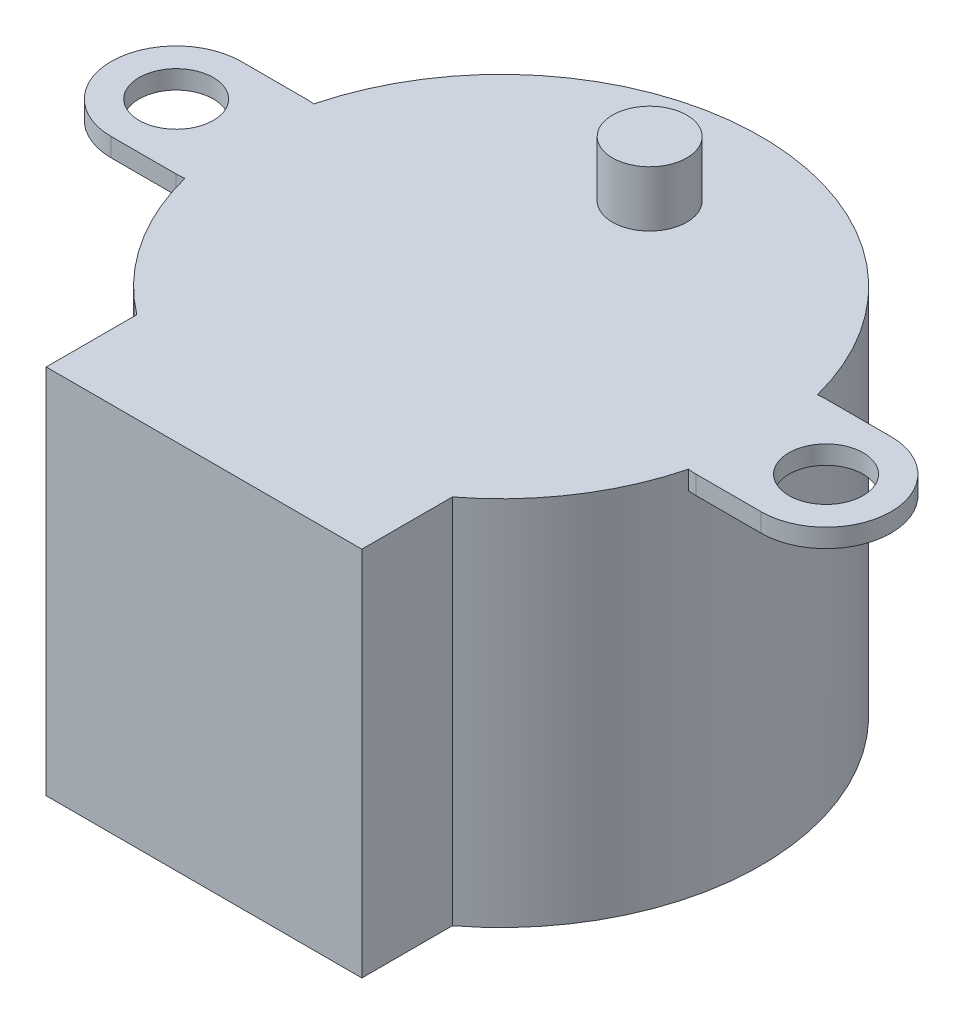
from build123d import *

# Parameters (mm, degrees)
BOSS_EXTRUDE1_DEPTH = 20
SKETCH2_R           = 2
BOSS_EXTRUDE2_DEPTH = 1
SKETCH3_R           = 2
BOSS_EXTRUDE3_DEPTH = 3


with BuildPart() as part:
    # Sketch1 → Boss-Extrude1 (new body)
    with BuildSketch(Plane(origin=(0, 0, 0), x_dir=(1, 0, 0), z_dir=(0, 1, 0))):
        with BuildLine():
            ThreePointArc((14, 0), (-6.204836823, 12.549900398), (-8.5, -11.124297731))
            Line((-8.5, -11.124297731), (8.5, -11.124297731))
            ThreePointArc((8.5, -11.124297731), (12.549900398, -6.204836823), (14, 0))
        make_face()
        with BuildLine():
            Line((8.5, -11.124297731), (-8.5, -11.124297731))
            ThreePointArc((-8.5, -11.124297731), (0, -14), (8.5, -11.124297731))
        make_face()
        with BuildLine():
            ThreePointArc((8.5, -11.124297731), (0, -14), (-8.5, -11.124297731))
            Line((-8.5, -11.124297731), (-8.5, -16))
            Line((-8.5, -16), (8.5, -16))
            Line((8.5, -16), (8.5, -11.124297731))
        make_face()
        with BuildLine():
            ThreePointArc((14, 0), (-6.204836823, 12.549900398), (-8.5, -11.124297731))
            Line((-8.5, -11.124297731), (8.5, -11.124297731))
            ThreePointArc((8.5, -11.124297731), (12.549900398, -6.204836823), (14, 0))
        make_face()
        with BuildLine():
            Line((8.5, -11.124297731), (-8.5, -11.124297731))
            ThreePointArc((-8.5, -11.124297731), (0, -14), (8.5, -11.124297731))
        make_face()
    extrude(amount=BOSS_EXTRUDE1_DEPTH)

    # Sketch2 → Boss-Extrude2 (add)
    # profile 1 of 2: a face of its own
    with BuildSketch(Plane(origin=(0, 20, 0), x_dir=(1, 0, 0), z_dir=(0, 1, 0))):
        with BuildLine():
            Line((14, 3.5), (17.5, 3.5))
            ThreePointArc((17.5, 3.5), (21, 0), (17.5, -3.5))
            Line((17.5, -3.5), (14, -3.5))
            ThreePointArc((14, -3.5), (10.5, 0), (14, 3.5))
        make_face()
        with Locations(Location((17.5, 0, 0), (0, 0, 270))):
            Circle(SKETCH2_R, mode=Mode.SUBTRACT)
    # profile 2 of 2: a face of its own
    with BuildSketch(Plane(origin=(0, 20, 0), x_dir=(1, 0, 0), z_dir=(0, 1, 0))):
        with BuildLine():
            Line((-14, 3.5), (-17.5, 3.5))
            ThreePointArc((-17.5, 3.5), (-21, 0), (-17.5, -3.5))
            Line((-17.5, -3.5), (-14, -3.5))
            ThreePointArc((-14, -3.5), (-10.5, 0), (-14, 3.5))
        make_face()
        with Locations(Location((-17.5, 0, 0), (0, 0, 90))):
            Circle(SKETCH2_R, mode=Mode.SUBTRACT)
    extrude(amount=-BOSS_EXTRUDE2_DEPTH)

    # Sketch3 → Boss-Extrude3 (add)
    with BuildSketch(Plane(origin=(0, 20, 0), x_dir=(1, 0, 0), z_dir=(0, 1, 0))):
        with Locations(Location((0, 8, 0), (0, 0, 270))):
            Circle(SKETCH3_R)
    extrude(amount=BOSS_EXTRUDE3_DEPTH)


solid = part.part
